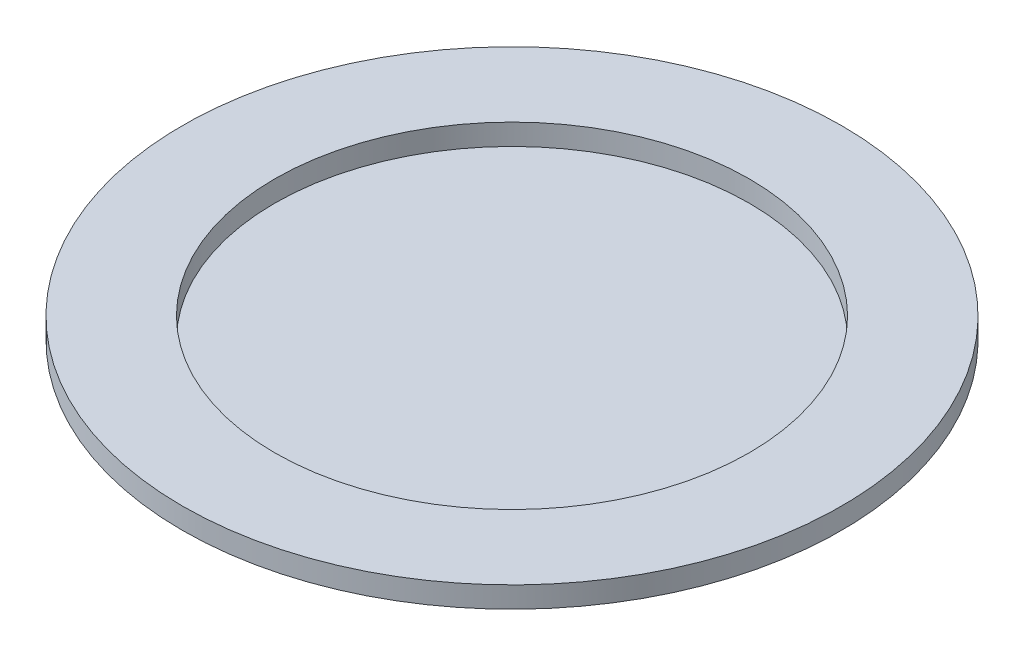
from build123d import *

# Parameters (mm, degrees)
SKETCH1_R           = 50
BOSS_EXTRUDE1_DEPTH = 4
SKETCH2_R           = 62.5
SKETCH2_R_2         = 45
BOSS_EXTRUDE2_DEPTH = 4


with BuildPart() as part:
    # Sketch1 → Boss-Extrude1 (new body)
    with BuildSketch(Plane(origin=(0, 0, 0), x_dir=(1, 0, 0), z_dir=(0, 1, 0))):
        with Locations(Location((0, 0, 0), (0, 0, 270))):
            Circle(SKETCH1_R)
    extrude(amount=BOSS_EXTRUDE1_DEPTH)

    # Sketch2 → Boss-Extrude2 (add)
    with BuildSketch(Plane(origin=(0, 4, 0), x_dir=(1, 0, 0), z_dir=(0, 1, 0))):
        with Locations(Location((0, 0, 0), (0, 0, 270))):
            Circle(SKETCH2_R)
        with Locations(Location((0, 0, 0), (0, 0, 270))):
            Circle(SKETCH2_R_2, mode=Mode.SUBTRACT)
    extrude(amount=BOSS_EXTRUDE2_DEPTH)


solid = part.part
